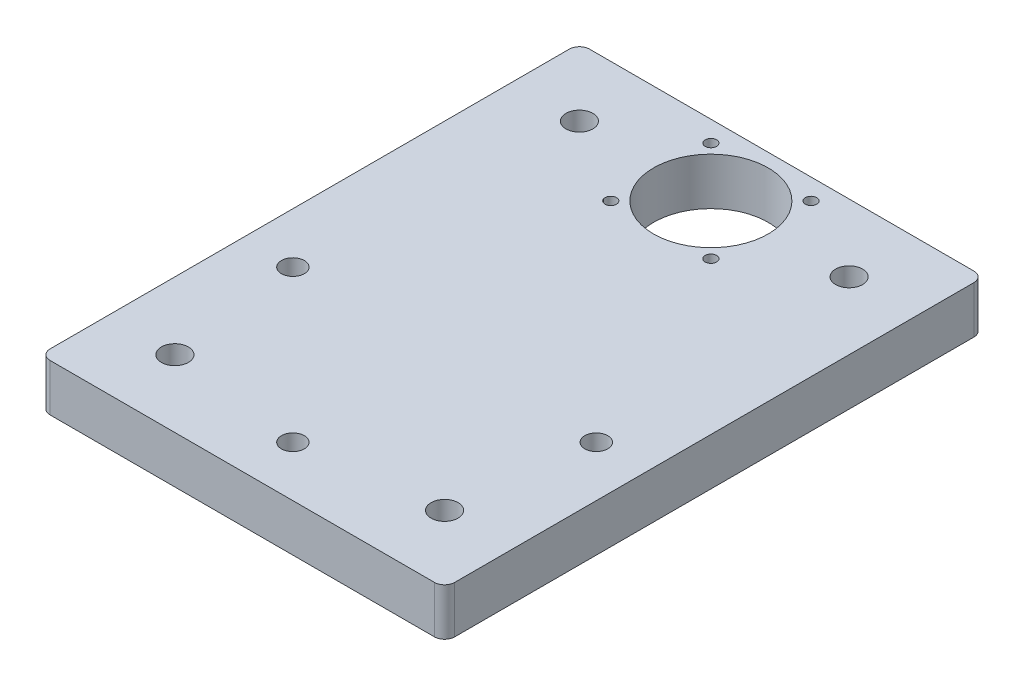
from build123d import *

# Parameters (mm, degrees)
EXTRUDE_1_DEPTH     = 14
SKETCH_3_R          = 1.7
CUT_EXTRUDE_1_DEPTH = 118.45637488
SKETCH_4_R          = 3.4
CUT_EXTRUDE_2_DEPTH = 118.45637488
SKETCH_5_R          = 16.999999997
CUT_EXTRUDE_3_DEPTH = 118.45637488
SKETCH_6_R          = 4
CUT_EXTRUDE_4_DEPTH = 118.45637488


with BuildPart() as part:
    # Sketch 1 → Extrude 1 (new body)
    with BuildSketch(Plane(origin=(0, 0, 0), x_dir=(1, 0, 0), z_dir=(0, 1, 0))):
        with BuildLine():
            Line((-57, -100), (57, -100))
            ThreePointArc((57, -100), (59.121320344, -99.121320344), (60, -97))
            Line((60, -97), (60, 57))
            ThreePointArc((60, 57), (59.121320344, 59.121320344), (57, 60))
            Line((57, 60), (-57, 60))
            ThreePointArc((-57, 60), (-59.121320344, 59.121320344), (-60, 57))
            Line((-60, 57), (-60, -97))
            ThreePointArc((-60, -97), (-59.121320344, -99.121320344), (-57, -100))
        make_face()
    extrude(amount=EXTRUDE_1_DEPTH)

    # Sketch 3 → Cut-Extrude 1 (cut, through all)
    with BuildSketch(Plane.XZ):
        with Locations(Location((14.849242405, -24.150757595, 0), (0, 0, 270))):
            Circle(SKETCH_3_R)
        with Locations(Location((14.849242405, -53.849242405, 0), (0, 0, 270))):
            Circle(SKETCH_3_R)
        with Locations(Location((-14.849242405, -53.849242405, 0), (0, 0, 270))):
            Circle(SKETCH_3_R)
        with Locations(Location((-14.849242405, -24.150757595, 0), (0, 0, 270))):
            Circle(SKETCH_3_R)
    extrude(amount=-CUT_EXTRUDE_1_DEPTH, mode=Mode.SUBTRACT)

    # Sketch 4 → Cut-Extrude 2 (cut, through all)
    with BuildSketch(Plane.XZ):
        with Locations(Location((0, 85, 0), (0, 0, 270))):
            Circle(SKETCH_4_R)
        with Locations(Location((45, 40, 0), (0, 0, 270))):
            Circle(SKETCH_4_R)
        with Locations(Location((-45, 40, 0), (0, 0, 270))):
            Circle(SKETCH_4_R)
    extrude(amount=-CUT_EXTRUDE_2_DEPTH, mode=Mode.SUBTRACT)

    # Sketch 5 → Cut-Extrude 3 (cut, through all)
    with BuildSketch(Plane(origin=(0, 14, 0), x_dir=(1, 0, 0), z_dir=(0, 1, 0))):
        with Locations(Location((4e-09, 38.999999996, 0), (0, 0, 270))):
            Circle(SKETCH_5_R)
    extrude(amount=-CUT_EXTRUDE_3_DEPTH, mode=Mode.SUBTRACT)

    # Sketch 6 → Cut-Extrude 4 (cut, through all)
    with BuildSketch(Plane.XZ):
        with Locations(Location((40, 80, 0), (0, 0, 270))):
            Circle(SKETCH_6_R)
        with Locations(Location((-40, 80, 0), (0, 0, 90))):
            Circle(SKETCH_6_R)
        with Locations(Location((40, -40, 0), (0, 0, 90))):
            Circle(SKETCH_6_R)
        with Locations(Location((-40, -40, 0), (0, 0, 270))):
            Circle(SKETCH_6_R)
    extrude(amount=-CUT_EXTRUDE_4_DEPTH, mode=Mode.SUBTRACT)


solid = part.part
